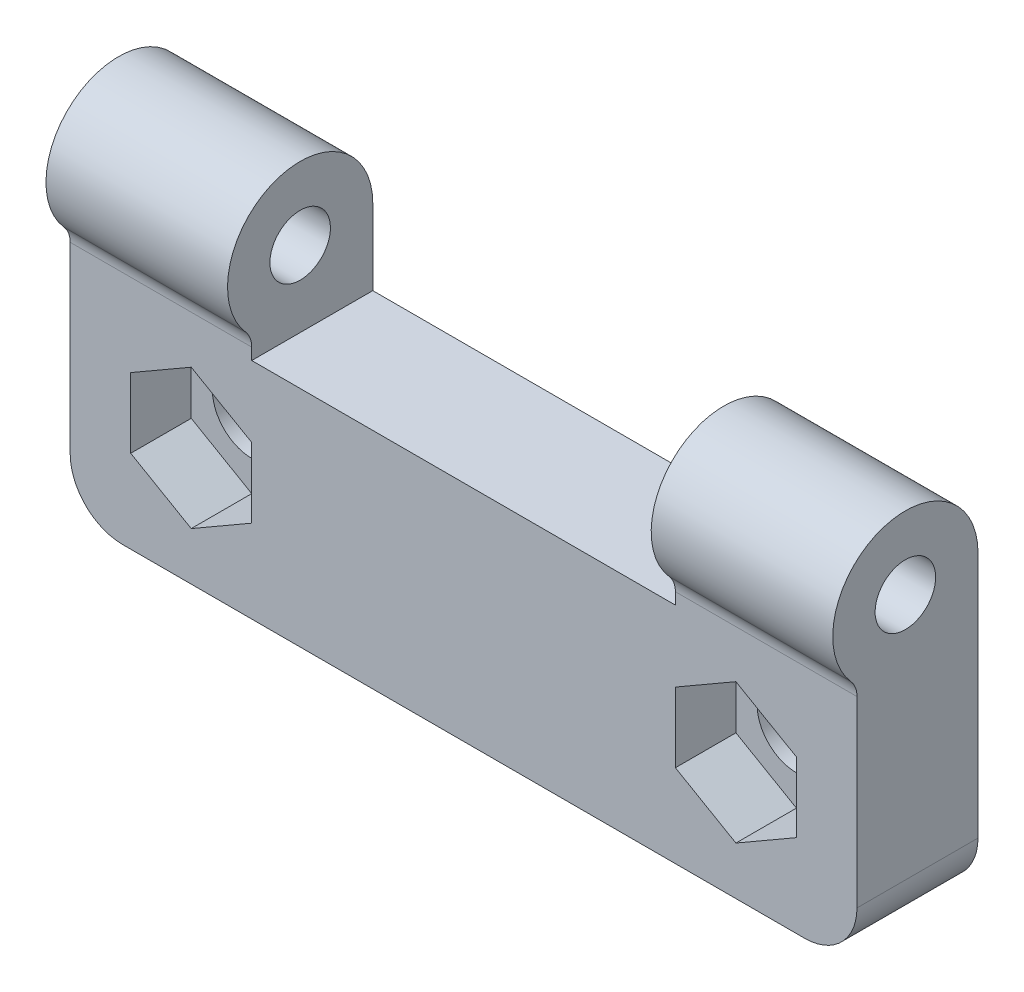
ISO-10303-21;
HEADER;
FILE_DESCRIPTION(('STEP AP214'),'2;1');
FILE_NAME('part.step','',(''),(''),'','','');
FILE_SCHEMA(('AUTOMOTIVE_DESIGN { 1 0 10303 214 1 1 1 1 }'));
ENDSEC;
DATA;
#1=APPLICATION_CONTEXT('core data for automotive mechanical design processes');
#2=APPLICATION_PROTOCOL_DEFINITION('international standard','automotive_design',2000,#1);
#3=PRODUCT_CONTEXT('',#1,'mechanical');
#4=PRODUCT('Part','Part','',(#3));
#5=PRODUCT_RELATED_PRODUCT_CATEGORY('part','',(#4));
#6=PRODUCT_DEFINITION_FORMATION('','',#4);
#7=PRODUCT_DEFINITION_CONTEXT('part definition',#1,'design');
#8=PRODUCT_DEFINITION('design','',#6,#7);
#9=PRODUCT_DEFINITION_SHAPE('','',#8);
#10=(LENGTH_UNIT() NAMED_UNIT(*) SI_UNIT(.MILLI.,.METRE.));
#11=(NAMED_UNIT(*) PLANE_ANGLE_UNIT() SI_UNIT($,.RADIAN.));
#12=(NAMED_UNIT(*) SI_UNIT($,.STERADIAN.) SOLID_ANGLE_UNIT());
#13=UNCERTAINTY_MEASURE_WITH_UNIT(LENGTH_MEASURE(1.E-05),#10,'distance_accuracy_value','');
#14=(GEOMETRIC_REPRESENTATION_CONTEXT(3) GLOBAL_UNCERTAINTY_ASSIGNED_CONTEXT((#13)) GLOBAL_UNIT_ASSIGNED_CONTEXT((#10,
#11,#12)) REPRESENTATION_CONTEXT('',''));
#15=CARTESIAN_POINT('',(0.,0.,0.));
#16=DIRECTION('',(0.,0.,1.));
#17=DIRECTION('',(1.,0.,0.));
#18=AXIS2_PLACEMENT_3D('',#15,#16,#17);
#19=CARTESIAN_POINT('',(0.,0.,5.));
#20=DIRECTION('',(0.,0.,1.));
#21=DIRECTION('',(-1.,0.,0.));
#22=AXIS2_PLACEMENT_3D('',#19,#20,#21);
#23=CYLINDRICAL_SURFACE('',#22,3.25);
#24=CARTESIAN_POINT('',(0.,0.,0.));
#25=DIRECTION('',(0.,0.,1.));
#26=DIRECTION('',(-1.,0.,0.));
#27=AXIS2_PLACEMENT_3D('',#24,#25,#26);
#28=CIRCLE('',#27,3.25);
#29=CARTESIAN_POINT('',(-3.25,0.,0.));
#30=VERTEX_POINT('',#29);
#31=EDGE_CURVE('E375',#30,#30,#28,.F.);
#32=ORIENTED_EDGE('',*,*,#31,.T.);
#33=EDGE_LOOP('',(#32));
#34=FACE_BOUND('',#33,.T.);
#35=CARTESIAN_POINT('',(0.,0.,5.));
#36=DIRECTION('',(0.,0.,1.));
#37=DIRECTION('',(-1.,0.,0.));
#38=AXIS2_PLACEMENT_3D('',#35,#36,#37);
#39=CIRCLE('',#38,3.25);
#40=CARTESIAN_POINT('',(-3.25,0.,5.));
#41=VERTEX_POINT('',#40);
#42=EDGE_CURVE('E18',#41,#41,#39,.F.);
#43=ORIENTED_EDGE('',*,*,#42,.F.);
#44=EDGE_LOOP('',(#43));
#45=FACE_BOUND('',#44,.T.);
#46=ADVANCED_FACE('F14',(#34,#45),#23,.F.);
#47=CARTESIAN_POINT('',(45.,0.,5.));
#48=DIRECTION('',(0.,0.,1.));
#49=DIRECTION('',(-1.,0.,0.));
#50=AXIS2_PLACEMENT_3D('',#47,#48,#49);
#51=CYLINDRICAL_SURFACE('',#50,3.25);
#52=CARTESIAN_POINT('',(45.,0.,0.));
#53=DIRECTION('',(0.,0.,1.));
#54=DIRECTION('',(-1.,0.,0.));
#55=AXIS2_PLACEMENT_3D('',#52,#53,#54);
#56=CIRCLE('',#55,3.25);
#57=CARTESIAN_POINT('',(41.75,0.,0.));
#58=VERTEX_POINT('',#57);
#59=EDGE_CURVE('E306',#58,#58,#56,.F.);
#60=ORIENTED_EDGE('',*,*,#59,.T.);
#61=EDGE_LOOP('',(#60));
#62=FACE_BOUND('',#61,.T.);
#63=CARTESIAN_POINT('',(45.,0.,5.));
#64=DIRECTION('',(0.,0.,1.));
#65=DIRECTION('',(-1.,0.,0.));
#66=AXIS2_PLACEMENT_3D('',#63,#64,#65);
#67=CIRCLE('',#66,3.25);
#68=CARTESIAN_POINT('',(41.75,0.,5.));
#69=VERTEX_POINT('',#68);
#70=EDGE_CURVE('E269',#69,#69,#67,.F.);
#71=ORIENTED_EDGE('',*,*,#70,.F.);
#72=EDGE_LOOP('',(#71));
#73=FACE_BOUND('',#72,.T.);
#74=ADVANCED_FACE('F405',(#62,#73),#51,.F.);
#75=CARTESIAN_POINT('',(-10.,9.70849737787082,12.));
#76=DIRECTION('',(-1.,0.,0.));
#77=DIRECTION('',(0.,-1.,0.));
#78=AXIS2_PLACEMENT_3D('',#75,#76,#77);
#79=CYLINDRICAL_SURFACE('',#78,2.);
#80=DIRECTION('',(-1.,0.,0.));
#81=VECTOR('',#80,1.);
#82=CARTESIAN_POINT('',(-10.,11.0313730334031,10.5));
#83=LINE('',#82,#81);
#84=CARTESIAN_POINT('',(-10.,11.0313730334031,10.5));
#85=VERTEX_POINT('',#84);
#86=CARTESIAN_POINT('',(5.,11.0313730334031,10.5));
#87=VERTEX_POINT('',#86);
#88=EDGE_CURVE('E359',#85,#87,#83,.F.);
#89=ORIENTED_EDGE('',*,*,#88,.F.);
#90=CARTESIAN_POINT('',(-10.,9.70849737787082,12.));
#91=DIRECTION('',(-1.,0.,0.));
#92=DIRECTION('',(0.,-1.,0.));
#93=AXIS2_PLACEMENT_3D('',#90,#91,#92);
#94=CIRCLE('',#93,2.);
#95=CARTESIAN_POINT('',(-10.,9.70849737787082,10.));
#96=VERTEX_POINT('',#95);
#97=EDGE_CURVE('E398',#96,#85,#94,.F.);
#98=ORIENTED_EDGE('',*,*,#97,.F.);
#99=DIRECTION('',(-1.,0.,0.));
#100=VECTOR('',#99,1.);
#101=CARTESIAN_POINT('',(22.5,9.70849737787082,10.));
#102=LINE('',#101,#100);
#103=CARTESIAN_POINT('',(5.,9.70849737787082,10.));
#104=VERTEX_POINT('',#103);
#105=EDGE_CURVE('E357',#104,#96,#102,.T.);
#106=ORIENTED_EDGE('',*,*,#105,.F.);
#107=CARTESIAN_POINT('',(5.,9.70849737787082,12.));
#108=DIRECTION('',(-1.,0.,0.));
#109=DIRECTION('',(0.,-1.,0.));
#110=AXIS2_PLACEMENT_3D('',#107,#108,#109);
#111=CIRCLE('',#110,2.);
#112=EDGE_CURVE('E396',#87,#104,#111,.T.);
#113=ORIENTED_EDGE('',*,*,#112,.F.);
#114=EDGE_LOOP('',(#89,#98,#106,#113));
#115=FACE_BOUND('',#114,.T.);
#116=ADVANCED_FACE('F16',(#115),#79,.F.);
#117=CARTESIAN_POINT('',(-10.,9.70849737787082,12.));
#118=DIRECTION('',(-1.,0.,0.));
#119=DIRECTION('',(0.,-1.,0.));
#120=AXIS2_PLACEMENT_3D('',#117,#118,#119);
#121=CYLINDRICAL_SURFACE('',#120,2.);
#122=DIRECTION('',(-1.,0.,0.));
#123=VECTOR('',#122,1.);
#124=CARTESIAN_POINT('',(22.5,9.70849737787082,10.));
#125=LINE('',#124,#123);
#126=CARTESIAN_POINT('',(55.,9.70849737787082,10.));
#127=VERTEX_POINT('',#126);
#128=CARTESIAN_POINT('',(40.,9.70849737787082,10.));
#129=VERTEX_POINT('',#128);
#130=EDGE_CURVE('E354',#127,#129,#125,.T.);
#131=ORIENTED_EDGE('',*,*,#130,.F.);
#132=CARTESIAN_POINT('',(55.,9.70849737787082,12.));
#133=DIRECTION('',(-1.,0.,0.));
#134=DIRECTION('',(0.,-1.,0.));
#135=AXIS2_PLACEMENT_3D('',#132,#133,#134);
#136=CIRCLE('',#135,2.);
#137=CARTESIAN_POINT('',(55.,11.0313730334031,10.5));
#138=VERTEX_POINT('',#137);
#139=EDGE_CURVE('E394',#138,#127,#136,.T.);
#140=ORIENTED_EDGE('',*,*,#139,.F.);
#141=DIRECTION('',(-1.,0.,0.));
#142=VECTOR('',#141,1.);
#143=CARTESIAN_POINT('',(-10.,11.0313730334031,10.5));
#144=LINE('',#143,#142);
#145=CARTESIAN_POINT('',(40.,11.0313730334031,10.5));
#146=VERTEX_POINT('',#145);
#147=EDGE_CURVE('E349',#146,#138,#144,.F.);
#148=ORIENTED_EDGE('',*,*,#147,.F.);
#149=CARTESIAN_POINT('',(40.,9.70849737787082,12.));
#150=DIRECTION('',(-1.,0.,0.));
#151=DIRECTION('',(0.,-1.,0.));
#152=AXIS2_PLACEMENT_3D('',#149,#150,#151);
#153=CIRCLE('',#152,2.);
#154=EDGE_CURVE('E363',#129,#146,#153,.F.);
#155=ORIENTED_EDGE('',*,*,#154,.F.);
#156=EDGE_LOOP('',(#131,#140,#148,#155));
#157=FACE_BOUND('',#156,.T.);
#158=ADVANCED_FACE('F416',(#157),#121,.F.);
#159=CARTESIAN_POINT('',(-10.,15.,6.));
#160=DIRECTION('',(-1.,0.,0.));
#161=DIRECTION('',(0.,-1.,0.));
#162=AXIS2_PLACEMENT_3D('',#159,#160,#161);
#163=CYLINDRICAL_SURFACE('',#162,2.5);
#164=CARTESIAN_POINT('',(5.,15.,6.));
#165=DIRECTION('',(-1.,0.,0.));
#166=DIRECTION('',(0.,-1.,0.));
#167=AXIS2_PLACEMENT_3D('',#164,#165,#166);
#168=CIRCLE('',#167,2.5);
#169=CARTESIAN_POINT('',(5.,12.5,6.));
#170=VERTEX_POINT('',#169);
#171=EDGE_CURVE('E344',#170,#170,#168,.F.);
#172=ORIENTED_EDGE('',*,*,#171,.T.);
#173=EDGE_LOOP('',(#172));
#174=FACE_BOUND('',#173,.T.);
#175=CARTESIAN_POINT('',(-10.,15.,6.));
#176=DIRECTION('',(-1.,0.,0.));
#177=DIRECTION('',(0.,-1.,0.));
#178=AXIS2_PLACEMENT_3D('',#175,#176,#177);
#179=CIRCLE('',#178,2.5);
#180=CARTESIAN_POINT('',(-10.,12.5,6.));
#181=VERTEX_POINT('',#180);
#182=EDGE_CURVE('E328',#181,#181,#179,.F.);
#183=ORIENTED_EDGE('',*,*,#182,.F.);
#184=EDGE_LOOP('',(#183));
#185=FACE_BOUND('',#184,.T.);
#186=ADVANCED_FACE('F517',(#174,#185),#163,.F.);
#187=CARTESIAN_POINT('',(22.5,15.,10.));
#188=DIRECTION('',(0.,0.,1.));
#189=DIRECTION('',(-1.,0.,0.));
#190=AXIS2_PLACEMENT_3D('',#187,#188,#189);
#191=PLANE('',#190);
#192=DIRECTION('',(0.866025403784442,-0.5,0.));
#193=VECTOR('',#192,1.);
#194=CARTESIAN_POINT('',(-5.,-2.8867513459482,10.));
#195=LINE('',#194,#193);
#196=CARTESIAN_POINT('',(-5.,-2.8867513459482,10.));
#197=VERTEX_POINT('',#196);
#198=CARTESIAN_POINT('',(0.,-5.77350269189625,10.));
#199=VERTEX_POINT('',#198);
#200=EDGE_CURVE('E31',#197,#199,#195,.T.);
#201=ORIENTED_EDGE('',*,*,#200,.F.);
#202=DIRECTION('',(0.,-1.,0.));
#203=VECTOR('',#202,1.);
#204=CARTESIAN_POINT('',(-5.,2.88675134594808,10.));
#205=LINE('',#204,#203);
#206=CARTESIAN_POINT('',(-5.,2.88675134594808,10.));
#207=VERTEX_POINT('',#206);
#208=EDGE_CURVE('E199',#207,#197,#205,.T.);
#209=ORIENTED_EDGE('',*,*,#208,.F.);
#210=DIRECTION('',(-0.866025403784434,-0.500000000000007,0.));
#211=VECTOR('',#210,1.);
#212=CARTESIAN_POINT('',(0.,5.77350269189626,10.));
#213=LINE('',#212,#211);
#214=CARTESIAN_POINT('',(0.,5.77350269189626,10.));
#215=VERTEX_POINT('',#214);
#216=EDGE_CURVE('E202',#215,#207,#213,.T.);
#217=ORIENTED_EDGE('',*,*,#216,.F.);
#218=DIRECTION('',(-0.866025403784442,0.5,0.));
#219=VECTOR('',#218,1.);
#220=CARTESIAN_POINT('',(5.,2.88675134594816,10.));
#221=LINE('',#220,#219);
#222=CARTESIAN_POINT('',(5.,2.88675134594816,10.));
#223=VERTEX_POINT('',#222);
#224=EDGE_CURVE('E218',#223,#215,#221,.T.);
#225=ORIENTED_EDGE('',*,*,#224,.F.);
#226=DIRECTION('',(0.,1.,0.));
#227=VECTOR('',#226,1.);
#228=CARTESIAN_POINT('',(5.,-2.8867513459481,10.));
#229=LINE('',#228,#227);
#230=CARTESIAN_POINT('',(5.,-2.8867513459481,10.));
#231=VERTEX_POINT('',#230);
#232=EDGE_CURVE('E215',#231,#223,#229,.T.);
#233=ORIENTED_EDGE('',*,*,#232,.F.);
#234=DIRECTION('',(0.866025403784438,0.5,0.));
#235=VECTOR('',#234,1.);
#236=CARTESIAN_POINT('',(0.,-5.77350269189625,10.));
#237=LINE('',#236,#235);
#238=EDGE_CURVE('E213',#199,#231,#237,.T.);
#239=ORIENTED_EDGE('',*,*,#238,.F.);
#240=EDGE_LOOP('',(#201,#209,#217,#225,#233,#239));
#241=FACE_BOUND('',#240,.T.);
#242=DIRECTION('',(0.866025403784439,-0.5,0.));
#243=VECTOR('',#242,1.);
#244=CARTESIAN_POINT('',(40.,-2.88675134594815,10.));
#245=LINE('',#244,#243);
#246=CARTESIAN_POINT('',(40.,-2.88675134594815,10.));
#247=VERTEX_POINT('',#246);
#248=CARTESIAN_POINT('',(45.,-5.77350269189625,10.));
#249=VERTEX_POINT('',#248);
#250=EDGE_CURVE('E39',#247,#249,#245,.T.);
#251=ORIENTED_EDGE('',*,*,#250,.F.);
#252=DIRECTION('',(0.,-1.,0.));
#253=VECTOR('',#252,1.);
#254=CARTESIAN_POINT('',(40.,2.88675134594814,10.));
#255=LINE('',#254,#253);
#256=CARTESIAN_POINT('',(40.,2.88675134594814,10.));
#257=VERTEX_POINT('',#256);
#258=EDGE_CURVE('E236',#257,#247,#255,.T.);
#259=ORIENTED_EDGE('',*,*,#258,.F.);
#260=DIRECTION('',(-0.866025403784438,-0.5,0.));
#261=VECTOR('',#260,1.);
#262=CARTESIAN_POINT('',(45.,5.77350269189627,10.));
#263=LINE('',#262,#261);
#264=CARTESIAN_POINT('',(45.,5.77350269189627,10.));
#265=VERTEX_POINT('',#264);
#266=EDGE_CURVE('E262',#265,#257,#263,.T.);
#267=ORIENTED_EDGE('',*,*,#266,.F.);
#268=DIRECTION('',(-0.866025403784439,0.5,0.));
#269=VECTOR('',#268,1.);
#270=CARTESIAN_POINT('',(50.,2.88675134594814,10.));
#271=LINE('',#270,#269);
#272=CARTESIAN_POINT('',(50.,2.88675134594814,10.));
#273=VERTEX_POINT('',#272);
#274=EDGE_CURVE('E259',#273,#265,#271,.T.);
#275=ORIENTED_EDGE('',*,*,#274,.F.);
#276=DIRECTION('',(0.,1.,0.));
#277=VECTOR('',#276,1.);
#278=CARTESIAN_POINT('',(50.,-2.88675134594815,10.));
#279=LINE('',#278,#277);
#280=CARTESIAN_POINT('',(50.,-2.88675134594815,10.));
#281=VERTEX_POINT('',#280);
#282=EDGE_CURVE('E256',#281,#273,#279,.T.);
#283=ORIENTED_EDGE('',*,*,#282,.F.);
#284=DIRECTION('',(0.866025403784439,0.5,0.));
#285=VECTOR('',#284,1.);
#286=CARTESIAN_POINT('',(45.,-5.77350269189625,10.));
#287=LINE('',#286,#285);
#288=EDGE_CURVE('E253',#249,#281,#287,.T.);
#289=ORIENTED_EDGE('',*,*,#288,.F.);
#290=EDGE_LOOP('',(#251,#259,#267,#275,#283,#289));
#291=FACE_BOUND('',#290,.T.);
#292=DIRECTION('',(0.,1.,0.));
#293=VECTOR('',#292,1.);
#294=CARTESIAN_POINT('',(55.,6.58333333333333,10.));
#295=LINE('',#294,#293);
#296=CARTESIAN_POINT('',(55.,-5.4166666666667,10.));
#297=VERTEX_POINT('',#296);
#298=EDGE_CURVE('E309',#127,#297,#295,.F.);
#299=ORIENTED_EDGE('',*,*,#298,.F.);
#300=ORIENTED_EDGE('',*,*,#130,.T.);
#301=DIRECTION('',(0.,-1.,0.));
#302=VECTOR('',#301,1.);
#303=CARTESIAN_POINT('',(40.,15.,10.));
#304=LINE('',#303,#302);
#305=CARTESIAN_POINT('',(40.,8.75,10.));
#306=VERTEX_POINT('',#305);
#307=EDGE_CURVE('E362',#129,#306,#304,.T.);
#308=ORIENTED_EDGE('',*,*,#307,.T.);
#309=DIRECTION('',(1.,0.,0.));
#310=VECTOR('',#309,1.);
#311=CARTESIAN_POINT('',(40.,8.75,10.));
#312=LINE('',#311,#310);
#313=CARTESIAN_POINT('',(5.,8.75,10.));
#314=VERTEX_POINT('',#313);
#315=EDGE_CURVE('E347',#306,#314,#312,.F.);
#316=ORIENTED_EDGE('',*,*,#315,.T.);
#317=DIRECTION('',(0.,-1.,0.));
#318=VECTOR('',#317,1.);
#319=CARTESIAN_POINT('',(5.,8.75,10.));
#320=LINE('',#319,#318);
#321=EDGE_CURVE('E335',#314,#104,#320,.F.);
#322=ORIENTED_EDGE('',*,*,#321,.T.);
#323=ORIENTED_EDGE('',*,*,#105,.T.);
#324=DIRECTION('',(0.,-1.,0.));
#325=VECTOR('',#324,1.);
#326=CARTESIAN_POINT('',(-10.,-5.4166666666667,10.));
#327=LINE('',#326,#325);
#328=CARTESIAN_POINT('',(-10.,-5.4166666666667,10.));
#329=VERTEX_POINT('',#328);
#330=EDGE_CURVE('E324',#329,#96,#327,.F.);
#331=ORIENTED_EDGE('',*,*,#330,.F.);
#332=CARTESIAN_POINT('',(-5.6666666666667,-5.4166666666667,10.));
#333=DIRECTION('',(0.,0.,-1.));
#334=DIRECTION('',(1.,0.,0.));
#335=AXIS2_PLACEMENT_3D('',#332,#333,#334);
#336=CIRCLE('',#335,4.33333333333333);
#337=CARTESIAN_POINT('',(-5.6666666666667,-9.75,10.));
#338=VERTEX_POINT('',#337);
#339=EDGE_CURVE('E323',#338,#329,#336,.T.);
#340=ORIENTED_EDGE('',*,*,#339,.F.);
#341=DIRECTION('',(1.,0.,0.));
#342=VECTOR('',#341,1.);
#343=CARTESIAN_POINT('',(50.6666666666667,-9.75,10.));
#344=LINE('',#343,#342);
#345=CARTESIAN_POINT('',(50.6666666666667,-9.75,10.));
#346=VERTEX_POINT('',#345);
#347=EDGE_CURVE('E320',#346,#338,#344,.F.);
#348=ORIENTED_EDGE('',*,*,#347,.F.);
#349=CARTESIAN_POINT('',(50.6666666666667,-5.4166666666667,10.));
#350=DIRECTION('',(0.,0.,-1.));
#351=DIRECTION('',(1.,0.,0.));
#352=AXIS2_PLACEMENT_3D('',#349,#350,#351);
#353=CIRCLE('',#352,4.33333333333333);
#354=EDGE_CURVE('E317',#297,#346,#353,.T.);
#355=ORIENTED_EDGE('',*,*,#354,.F.);
#356=EDGE_LOOP('',(#299,#300,#308,#316,#322,#323,#331,#340,#348,#355));
#357=FACE_BOUND('',#356,.T.);
#358=ADVANCED_FACE('F479',(#241,#291,#357),#191,.T.);
#359=CARTESIAN_POINT('',(-10.,15.,6.));
#360=DIRECTION('',(-1.,0.,0.));
#361=DIRECTION('',(0.,-1.,0.));
#362=AXIS2_PLACEMENT_3D('',#359,#360,#361);
#363=CYLINDRICAL_SURFACE('',#362,2.5);
#364=CARTESIAN_POINT('',(55.,15.,6.));
#365=DIRECTION('',(-1.,0.,0.));
#366=DIRECTION('',(0.,-1.,0.));
#367=AXIS2_PLACEMENT_3D('',#364,#365,#366);
#368=CIRCLE('',#367,2.5);
#369=CARTESIAN_POINT('',(55.,12.5,6.));
#370=VERTEX_POINT('',#369);
#371=EDGE_CURVE('E312',#370,#370,#368,.T.);
#372=ORIENTED_EDGE('',*,*,#371,.F.);
#373=EDGE_LOOP('',(#372));
#374=FACE_BOUND('',#373,.T.);
#375=CARTESIAN_POINT('',(40.,15.,6.));
#376=DIRECTION('',(-1.,0.,0.));
#377=DIRECTION('',(0.,-1.,0.));
#378=AXIS2_PLACEMENT_3D('',#375,#376,#377);
#379=CIRCLE('',#378,2.5);
#380=CARTESIAN_POINT('',(40.,12.5,6.));
#381=VERTEX_POINT('',#380);
#382=EDGE_CURVE('E299',#381,#381,#379,.T.);
#383=ORIENTED_EDGE('',*,*,#382,.T.);
#384=EDGE_LOOP('',(#383));
#385=FACE_BOUND('',#384,.T.);
#386=ADVANCED_FACE('F473',(#374,#385),#363,.F.);
#387=CARTESIAN_POINT('',(40.,8.75,0.));
#388=DIRECTION('',(0.,-1.,0.));
#389=DIRECTION('',(1.,0.,0.));
#390=AXIS2_PLACEMENT_3D('',#387,#388,#389);
#391=PLANE('',#390);
#392=DIRECTION('',(0.,0.,1.));
#393=VECTOR('',#392,1.);
#394=CARTESIAN_POINT('',(40.,8.75,0.));
#395=LINE('',#394,#393);
#396=CARTESIAN_POINT('',(40.,8.75,0.));
#397=VERTEX_POINT('',#396);
#398=EDGE_CURVE('E295',#306,#397,#395,.F.);
#399=ORIENTED_EDGE('',*,*,#398,.T.);
#400=DIRECTION('',(-1.,0.,0.));
#401=VECTOR('',#400,1.);
#402=CARTESIAN_POINT('',(22.5,8.75,0.));
#403=LINE('',#402,#401);
#404=CARTESIAN_POINT('',(5.,8.75,0.));
#405=VERTEX_POINT('',#404);
#406=EDGE_CURVE('E302',#397,#405,#403,.T.);
#407=ORIENTED_EDGE('',*,*,#406,.T.);
#408=DIRECTION('',(0.,0.,1.));
#409=VECTOR('',#408,1.);
#410=CARTESIAN_POINT('',(5.,8.75,0.));
#411=LINE('',#410,#409);
#412=EDGE_CURVE('E339',#405,#314,#411,.T.);
#413=ORIENTED_EDGE('',*,*,#412,.T.);
#414=ORIENTED_EDGE('',*,*,#315,.F.);
#415=EDGE_LOOP('',(#399,#407,#413,#414));
#416=FACE_BOUND('',#415,.T.);
#417=ADVANCED_FACE('F470',(#416),#391,.F.);
#418=CARTESIAN_POINT('',(5.,8.75,0.));
#419=DIRECTION('',(-1.,0.,0.));
#420=DIRECTION('',(0.,-1.,0.));
#421=AXIS2_PLACEMENT_3D('',#418,#419,#420);
#422=PLANE('',#421);
#423=ORIENTED_EDGE('',*,*,#112,.T.);
#424=ORIENTED_EDGE('',*,*,#321,.F.);
#425=ORIENTED_EDGE('',*,*,#412,.F.);
#426=DIRECTION('',(0.,-1.,0.));
#427=VECTOR('',#426,1.);
#428=CARTESIAN_POINT('',(5.,15.,0.));
#429=LINE('',#428,#427);
#430=CARTESIAN_POINT('',(5.,15.,0.));
#431=VERTEX_POINT('',#430);
#432=EDGE_CURVE('E305',#405,#431,#429,.F.);
#433=ORIENTED_EDGE('',*,*,#432,.T.);
#434=CARTESIAN_POINT('',(5.,15.,6.));
#435=DIRECTION('',(-1.,0.,0.));
#436=DIRECTION('',(0.,-1.,0.));
#437=AXIS2_PLACEMENT_3D('',#434,#435,#436);
#438=CIRCLE('',#437,6.);
#439=EDGE_CURVE('E338',#87,#431,#438,.T.);
#440=ORIENTED_EDGE('',*,*,#439,.F.);
#441=EDGE_LOOP('',(#423,#424,#425,#433,#440));
#442=FACE_BOUND('',#441,.T.);
#443=ORIENTED_EDGE('',*,*,#171,.F.);
#444=EDGE_LOOP('',(#443));
#445=FACE_BOUND('',#444,.T.);
#446=ADVANCED_FACE('F467',(#442,#445),#422,.F.);
#447=CARTESIAN_POINT('',(-10.,15.,6.));
#448=DIRECTION('',(-1.,0.,0.));
#449=DIRECTION('',(0.,-1.,0.));
#450=AXIS2_PLACEMENT_3D('',#447,#448,#449);
#451=CYLINDRICAL_SURFACE('',#450,6.);
#452=DIRECTION('',(-1.,0.,0.));
#453=VECTOR('',#452,1.);
#454=CARTESIAN_POINT('',(22.5,15.,0.));
#455=LINE('',#454,#453);
#456=CARTESIAN_POINT('',(-10.,15.,0.));
#457=VERTEX_POINT('',#456);
#458=EDGE_CURVE('E290',#431,#457,#455,.T.);
#459=ORIENTED_EDGE('',*,*,#458,.T.);
#460=CARTESIAN_POINT('',(-10.,15.,6.));
#461=DIRECTION('',(-1.,0.,0.));
#462=DIRECTION('',(0.,-1.,0.));
#463=AXIS2_PLACEMENT_3D('',#460,#461,#462);
#464=CIRCLE('',#463,6.);
#465=EDGE_CURVE('E327',#85,#457,#464,.T.);
#466=ORIENTED_EDGE('',*,*,#465,.F.);
#467=ORIENTED_EDGE('',*,*,#88,.T.);
#468=ORIENTED_EDGE('',*,*,#439,.T.);
#469=EDGE_LOOP('',(#459,#466,#467,#468));
#470=FACE_BOUND('',#469,.T.);
#471=ADVANCED_FACE('F463',(#470),#451,.T.);
#472=CARTESIAN_POINT('',(-10.,-5.4166666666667,0.));
#473=DIRECTION('',(-1.,0.,0.));
#474=DIRECTION('',(0.,-1.,0.));
#475=AXIS2_PLACEMENT_3D('',#472,#473,#474);
#476=PLANE('',#475);
#477=ORIENTED_EDGE('',*,*,#97,.T.);
#478=ORIENTED_EDGE('',*,*,#465,.T.);
#479=DIRECTION('',(0.,-1.,0.));
#480=VECTOR('',#479,1.);
#481=CARTESIAN_POINT('',(-10.,15.,0.));
#482=LINE('',#481,#480);
#483=CARTESIAN_POINT('',(-10.,-5.4166666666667,0.));
#484=VERTEX_POINT('',#483);
#485=EDGE_CURVE('E287',#457,#484,#482,.T.);
#486=ORIENTED_EDGE('',*,*,#485,.T.);
#487=DIRECTION('',(0.,0.,-1.));
#488=VECTOR('',#487,1.);
#489=CARTESIAN_POINT('',(-10.,-5.4166666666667,0.));
#490=LINE('',#489,#488);
#491=EDGE_CURVE('E321',#329,#484,#490,.T.);
#492=ORIENTED_EDGE('',*,*,#491,.F.);
#493=ORIENTED_EDGE('',*,*,#330,.T.);
#494=EDGE_LOOP('',(#477,#478,#486,#492,#493));
#495=FACE_BOUND('',#494,.T.);
#496=ORIENTED_EDGE('',*,*,#182,.T.);
#497=EDGE_LOOP('',(#496));
#498=FACE_BOUND('',#497,.T.);
#499=ADVANCED_FACE('F459',(#495,#498),#476,.T.);
#500=CARTESIAN_POINT('',(-5.6666666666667,-5.4166666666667,0.));
#501=DIRECTION('',(0.,0.,-1.));
#502=DIRECTION('',(1.,0.,0.));
#503=AXIS2_PLACEMENT_3D('',#500,#501,#502);
#504=CYLINDRICAL_SURFACE('',#503,4.33333333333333);
#505=CARTESIAN_POINT('',(-5.6666666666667,-5.4166666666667,0.));
#506=DIRECTION('',(0.,0.,-1.));
#507=DIRECTION('',(1.,0.,0.));
#508=AXIS2_PLACEMENT_3D('',#505,#506,#507);
#509=CIRCLE('',#508,4.33333333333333);
#510=CARTESIAN_POINT('',(-5.6666666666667,-9.75,0.));
#511=VERTEX_POINT('',#510);
#512=EDGE_CURVE('E286',#484,#511,#509,.F.);
#513=ORIENTED_EDGE('',*,*,#512,.T.);
#514=DIRECTION('',(0.,0.,1.));
#515=VECTOR('',#514,1.);
#516=CARTESIAN_POINT('',(-5.6666666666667,-9.75,0.));
#517=LINE('',#516,#515);
#518=EDGE_CURVE('E318',#338,#511,#517,.F.);
#519=ORIENTED_EDGE('',*,*,#518,.F.);
#520=ORIENTED_EDGE('',*,*,#339,.T.);
#521=ORIENTED_EDGE('',*,*,#491,.T.);
#522=EDGE_LOOP('',(#513,#519,#520,#521));
#523=FACE_BOUND('',#522,.T.);
#524=ADVANCED_FACE('F455',(#523),#504,.T.);
#525=CARTESIAN_POINT('',(50.6666666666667,-9.75,0.));
#526=DIRECTION('',(0.,-1.,0.));
#527=DIRECTION('',(1.,0.,0.));
#528=AXIS2_PLACEMENT_3D('',#525,#526,#527);
#529=PLANE('',#528);
#530=DIRECTION('',(-1.,0.,0.));
#531=VECTOR('',#530,1.);
#532=CARTESIAN_POINT('',(22.5,-9.75,0.));
#533=LINE('',#532,#531);
#534=CARTESIAN_POINT('',(50.6666666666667,-9.75,0.));
#535=VERTEX_POINT('',#534);
#536=EDGE_CURVE('E283',#511,#535,#533,.F.);
#537=ORIENTED_EDGE('',*,*,#536,.T.);
#538=DIRECTION('',(0.,0.,-1.));
#539=VECTOR('',#538,1.);
#540=CARTESIAN_POINT('',(50.6666666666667,-9.75,0.));
#541=LINE('',#540,#539);
#542=EDGE_CURVE('E315',#346,#535,#541,.T.);
#543=ORIENTED_EDGE('',*,*,#542,.F.);
#544=ORIENTED_EDGE('',*,*,#347,.T.);
#545=ORIENTED_EDGE('',*,*,#518,.T.);
#546=EDGE_LOOP('',(#537,#543,#544,#545));
#547=FACE_BOUND('',#546,.T.);
#548=ADVANCED_FACE('F451',(#547),#529,.T.);
#549=CARTESIAN_POINT('',(50.6666666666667,-5.4166666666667,0.));
#550=DIRECTION('',(0.,0.,-1.));
#551=DIRECTION('',(1.,0.,0.));
#552=AXIS2_PLACEMENT_3D('',#549,#550,#551);
#553=CYLINDRICAL_SURFACE('',#552,4.33333333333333);
#554=CARTESIAN_POINT('',(50.6666666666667,-5.4166666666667,0.));
#555=DIRECTION('',(0.,0.,-1.));
#556=DIRECTION('',(1.,0.,0.));
#557=AXIS2_PLACEMENT_3D('',#554,#555,#556);
#558=CIRCLE('',#557,4.33333333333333);
#559=CARTESIAN_POINT('',(55.,-5.4166666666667,0.));
#560=VERTEX_POINT('',#559);
#561=EDGE_CURVE('E282',#535,#560,#558,.F.);
#562=ORIENTED_EDGE('',*,*,#561,.T.);
#563=DIRECTION('',(0.,0.,1.));
#564=VECTOR('',#563,1.);
#565=CARTESIAN_POINT('',(55.,-5.4166666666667,0.));
#566=LINE('',#565,#564);
#567=EDGE_CURVE('E311',#297,#560,#566,.F.);
#568=ORIENTED_EDGE('',*,*,#567,.F.);
#569=ORIENTED_EDGE('',*,*,#354,.T.);
#570=ORIENTED_EDGE('',*,*,#542,.T.);
#571=EDGE_LOOP('',(#562,#568,#569,#570));
#572=FACE_BOUND('',#571,.T.);
#573=ADVANCED_FACE('F447',(#572),#553,.T.);
#574=CARTESIAN_POINT('',(55.,6.58333333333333,0.));
#575=DIRECTION('',(1.,0.,0.));
#576=DIRECTION('',(0.,1.,0.));
#577=AXIS2_PLACEMENT_3D('',#574,#575,#576);
#578=PLANE('',#577);
#579=CARTESIAN_POINT('',(55.,15.,6.));
#580=DIRECTION('',(-1.,0.,0.));
#581=DIRECTION('',(0.,-1.,0.));
#582=AXIS2_PLACEMENT_3D('',#579,#580,#581);
#583=CIRCLE('',#582,6.);
#584=CARTESIAN_POINT('',(55.,15.,0.));
#585=VERTEX_POINT('',#584);
#586=EDGE_CURVE('E314',#138,#585,#583,.T.);
#587=ORIENTED_EDGE('',*,*,#586,.F.);
#588=ORIENTED_EDGE('',*,*,#139,.T.);
#589=ORIENTED_EDGE('',*,*,#298,.T.);
#590=ORIENTED_EDGE('',*,*,#567,.T.);
#591=DIRECTION('',(0.,-1.,0.));
#592=VECTOR('',#591,1.);
#593=CARTESIAN_POINT('',(55.,15.,0.));
#594=LINE('',#593,#592);
#595=EDGE_CURVE('E279',#560,#585,#594,.F.);
#596=ORIENTED_EDGE('',*,*,#595,.T.);
#597=EDGE_LOOP('',(#587,#588,#589,#590,#596));
#598=FACE_BOUND('',#597,.T.);
#599=ORIENTED_EDGE('',*,*,#371,.T.);
#600=EDGE_LOOP('',(#599));
#601=FACE_BOUND('',#600,.T.);
#602=ADVANCED_FACE('F443',(#598,#601),#578,.T.);
#603=CARTESIAN_POINT('',(-10.,15.,6.));
#604=DIRECTION('',(-1.,0.,0.));
#605=DIRECTION('',(0.,-1.,0.));
#606=AXIS2_PLACEMENT_3D('',#603,#604,#605);
#607=CYLINDRICAL_SURFACE('',#606,6.);
#608=DIRECTION('',(-1.,0.,0.));
#609=VECTOR('',#608,1.);
#610=CARTESIAN_POINT('',(22.5,15.,0.));
#611=LINE('',#610,#609);
#612=CARTESIAN_POINT('',(40.,15.,0.));
#613=VERTEX_POINT('',#612);
#614=EDGE_CURVE('E23',#585,#613,#611,.T.);
#615=ORIENTED_EDGE('',*,*,#614,.T.);
#616=CARTESIAN_POINT('',(40.,15.,6.));
#617=DIRECTION('',(-1.,0.,0.));
#618=DIRECTION('',(0.,-1.,0.));
#619=AXIS2_PLACEMENT_3D('',#616,#617,#618);
#620=CIRCLE('',#619,6.);
#621=EDGE_CURVE('E298',#613,#146,#620,.F.);
#622=ORIENTED_EDGE('',*,*,#621,.T.);
#623=ORIENTED_EDGE('',*,*,#147,.T.);
#624=ORIENTED_EDGE('',*,*,#586,.T.);
#625=EDGE_LOOP('',(#615,#622,#623,#624));
#626=FACE_BOUND('',#625,.T.);
#627=ADVANCED_FACE('F433',(#626),#607,.T.);
#628=CARTESIAN_POINT('',(40.,28.75,0.));
#629=DIRECTION('',(1.,0.,0.));
#630=DIRECTION('',(0.,1.,0.));
#631=AXIS2_PLACEMENT_3D('',#628,#629,#630);
#632=PLANE('',#631);
#633=DIRECTION('',(0.,-1.,0.));
#634=VECTOR('',#633,1.);
#635=CARTESIAN_POINT('',(40.,15.,0.));
#636=LINE('',#635,#634);
#637=EDGE_CURVE('E9',#613,#397,#636,.T.);
#638=ORIENTED_EDGE('',*,*,#637,.T.);
#639=ORIENTED_EDGE('',*,*,#398,.F.);
#640=ORIENTED_EDGE('',*,*,#307,.F.);
#641=ORIENTED_EDGE('',*,*,#154,.T.);
#642=ORIENTED_EDGE('',*,*,#621,.F.);
#643=EDGE_LOOP('',(#638,#639,#640,#641,#642));
#644=FACE_BOUND('',#643,.T.);
#645=ORIENTED_EDGE('',*,*,#382,.F.);
#646=EDGE_LOOP('',(#645));
#647=FACE_BOUND('',#646,.T.);
#648=ADVANCED_FACE('F422',(#644,#647),#632,.F.);
#649=CARTESIAN_POINT('',(22.5,15.,0.));
#650=DIRECTION('',(0.,0.,1.));
#651=DIRECTION('',(-1.,0.,0.));
#652=AXIS2_PLACEMENT_3D('',#649,#650,#651);
#653=PLANE('',#652);
#654=ORIENTED_EDGE('',*,*,#614,.F.);
#655=ORIENTED_EDGE('',*,*,#595,.F.);
#656=ORIENTED_EDGE('',*,*,#561,.F.);
#657=ORIENTED_EDGE('',*,*,#536,.F.);
#658=ORIENTED_EDGE('',*,*,#512,.F.);
#659=ORIENTED_EDGE('',*,*,#485,.F.);
#660=ORIENTED_EDGE('',*,*,#458,.F.);
#661=ORIENTED_EDGE('',*,*,#432,.F.);
#662=ORIENTED_EDGE('',*,*,#406,.F.);
#663=ORIENTED_EDGE('',*,*,#637,.F.);
#664=EDGE_LOOP('',(#654,#655,#656,#657,#658,#659,#660,#661,#662,#663));
#665=FACE_BOUND('',#664,.T.);
#666=ORIENTED_EDGE('',*,*,#59,.F.);
#667=EDGE_LOOP('',(#666));
#668=FACE_BOUND('',#667,.T.);
#669=ORIENTED_EDGE('',*,*,#31,.F.);
#670=EDGE_LOOP('',(#669));
#671=FACE_BOUND('',#670,.T.);
#672=ADVANCED_FACE('F409',(#665,#668,#671),#653,.F.);
#673=CARTESIAN_POINT('',(45.,-5.77350269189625,5.));
#674=DIRECTION('',(0.,0.,1.));
#675=DIRECTION('',(-1.,0.,0.));
#676=AXIS2_PLACEMENT_3D('',#673,#674,#675);
#677=PLANE('',#676);
#678=DIRECTION('',(0.866025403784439,-0.5,0.));
#679=VECTOR('',#678,1.);
#680=CARTESIAN_POINT('',(40.,-2.88675134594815,5.));
#681=LINE('',#680,#679);
#682=CARTESIAN_POINT('',(40.,-2.88675134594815,5.));
#683=VERTEX_POINT('',#682);
#684=CARTESIAN_POINT('',(45.,-5.77350269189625,5.));
#685=VERTEX_POINT('',#684);
#686=EDGE_CURVE('E232',#683,#685,#681,.T.);
#687=ORIENTED_EDGE('',*,*,#686,.T.);
#688=DIRECTION('',(0.866025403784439,0.5,0.));
#689=VECTOR('',#688,1.);
#690=CARTESIAN_POINT('',(45.,-5.77350269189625,5.));
#691=LINE('',#690,#689);
#692=CARTESIAN_POINT('',(50.,-2.88675134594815,5.));
#693=VERTEX_POINT('',#692);
#694=EDGE_CURVE('E235',#685,#693,#691,.T.);
#695=ORIENTED_EDGE('',*,*,#694,.T.);
#696=DIRECTION('',(0.,1.,0.));
#697=VECTOR('',#696,1.);
#698=CARTESIAN_POINT('',(50.,-2.88675134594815,5.));
#699=LINE('',#698,#697);
#700=CARTESIAN_POINT('',(50.,2.88675134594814,5.));
#701=VERTEX_POINT('',#700);
#702=EDGE_CURVE('E239',#693,#701,#699,.T.);
#703=ORIENTED_EDGE('',*,*,#702,.T.);
#704=DIRECTION('',(-0.866025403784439,0.5,0.));
#705=VECTOR('',#704,1.);
#706=CARTESIAN_POINT('',(50.,2.88675134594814,5.));
#707=LINE('',#706,#705);
#708=CARTESIAN_POINT('',(45.,5.77350269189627,5.));
#709=VERTEX_POINT('',#708);
#710=EDGE_CURVE('E242',#701,#709,#707,.T.);
#711=ORIENTED_EDGE('',*,*,#710,.T.);
#712=DIRECTION('',(-0.866025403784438,-0.5,0.));
#713=VECTOR('',#712,1.);
#714=CARTESIAN_POINT('',(45.,5.77350269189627,5.));
#715=LINE('',#714,#713);
#716=CARTESIAN_POINT('',(40.,2.88675134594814,5.));
#717=VERTEX_POINT('',#716);
#718=EDGE_CURVE('E245',#709,#717,#715,.T.);
#719=ORIENTED_EDGE('',*,*,#718,.T.);
#720=DIRECTION('',(0.,-1.,0.));
#721=VECTOR('',#720,1.);
#722=CARTESIAN_POINT('',(40.,2.88675134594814,5.));
#723=LINE('',#722,#721);
#724=EDGE_CURVE('E248',#717,#683,#723,.T.);
#725=ORIENTED_EDGE('',*,*,#724,.T.);
#726=EDGE_LOOP('',(#687,#695,#703,#711,#719,#725));
#727=FACE_BOUND('',#726,.T.);
#728=ORIENTED_EDGE('',*,*,#70,.T.);
#729=EDGE_LOOP('',(#728));
#730=FACE_BOUND('',#729,.T.);
#731=ADVANCED_FACE('F403',(#727,#730),#677,.T.);
#732=CARTESIAN_POINT('',(40.,-2.88675134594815,5.));
#733=DIRECTION('',(-0.5,-0.866025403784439,0.));
#734=DIRECTION('',(0.866025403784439,-0.5,0.));
#735=AXIS2_PLACEMENT_3D('',#732,#733,#734);
#736=PLANE('',#735);
#737=ORIENTED_EDGE('',*,*,#250,.T.);
#738=DIRECTION('',(0.,0.,1.));
#739=VECTOR('',#738,1.);
#740=CARTESIAN_POINT('',(45.,-5.77350269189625,5.));
#741=LINE('',#740,#739);
#742=EDGE_CURVE('E251',#685,#249,#741,.T.);
#743=ORIENTED_EDGE('',*,*,#742,.F.);
#744=ORIENTED_EDGE('',*,*,#686,.F.);
#745=DIRECTION('',(0.,0.,1.));
#746=VECTOR('',#745,1.);
#747=CARTESIAN_POINT('',(40.,-2.88675134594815,5.));
#748=LINE('',#747,#746);
#749=EDGE_CURVE('E267',#683,#247,#748,.T.);
#750=ORIENTED_EDGE('',*,*,#749,.T.);
#751=EDGE_LOOP('',(#737,#743,#744,#750));
#752=FACE_BOUND('',#751,.T.);
#753=ADVANCED_FACE('F430',(#752),#736,.F.);
#754=CARTESIAN_POINT('',(40.,2.88675134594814,5.));
#755=DIRECTION('',(-1.,0.,0.));
#756=DIRECTION('',(0.,-1.,0.));
#757=AXIS2_PLACEMENT_3D('',#754,#755,#756);
#758=PLANE('',#757);
#759=ORIENTED_EDGE('',*,*,#258,.T.);
#760=ORIENTED_EDGE('',*,*,#749,.F.);
#761=ORIENTED_EDGE('',*,*,#724,.F.);
#762=DIRECTION('',(0.,0.,1.));
#763=VECTOR('',#762,1.);
#764=CARTESIAN_POINT('',(40.,2.88675134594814,5.));
#765=LINE('',#764,#763);
#766=EDGE_CURVE('E270',#717,#257,#765,.T.);
#767=ORIENTED_EDGE('',*,*,#766,.T.);
#768=EDGE_LOOP('',(#759,#760,#761,#767));
#769=FACE_BOUND('',#768,.T.);
#770=ADVANCED_FACE('F643',(#769),#758,.F.);
#771=CARTESIAN_POINT('',(45.,5.77350269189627,5.));
#772=DIRECTION('',(-0.5,0.866025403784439,0.));
#773=DIRECTION('',(-0.866025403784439,-0.5,0.));
#774=AXIS2_PLACEMENT_3D('',#771,#772,#773);
#775=PLANE('',#774);
#776=ORIENTED_EDGE('',*,*,#266,.T.);
#777=ORIENTED_EDGE('',*,*,#766,.F.);
#778=ORIENTED_EDGE('',*,*,#718,.F.);
#779=DIRECTION('',(0.,0.,1.));
#780=VECTOR('',#779,1.);
#781=CARTESIAN_POINT('',(45.,5.77350269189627,5.));
#782=LINE('',#781,#780);
#783=EDGE_CURVE('E272',#709,#265,#782,.T.);
#784=ORIENTED_EDGE('',*,*,#783,.T.);
#785=EDGE_LOOP('',(#776,#777,#778,#784));
#786=FACE_BOUND('',#785,.T.);
#787=ADVANCED_FACE('F649',(#786),#775,.F.);
#788=CARTESIAN_POINT('',(50.,2.88675134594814,5.));
#789=DIRECTION('',(0.5,0.866025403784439,0.));
#790=DIRECTION('',(-0.866025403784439,0.5,0.));
#791=AXIS2_PLACEMENT_3D('',#788,#789,#790);
#792=PLANE('',#791);
#793=ORIENTED_EDGE('',*,*,#274,.T.);
#794=ORIENTED_EDGE('',*,*,#783,.F.);
#795=ORIENTED_EDGE('',*,*,#710,.F.);
#796=DIRECTION('',(0.,0.,1.));
#797=VECTOR('',#796,1.);
#798=CARTESIAN_POINT('',(50.,2.88675134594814,5.));
#799=LINE('',#798,#797);
#800=EDGE_CURVE('E274',#701,#273,#799,.T.);
#801=ORIENTED_EDGE('',*,*,#800,.T.);
#802=EDGE_LOOP('',(#793,#794,#795,#801));
#803=FACE_BOUND('',#802,.T.);
#804=ADVANCED_FACE('F658',(#803),#792,.F.);
#805=CARTESIAN_POINT('',(50.,-2.88675134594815,5.));
#806=DIRECTION('',(1.,0.,0.));
#807=DIRECTION('',(0.,1.,0.));
#808=AXIS2_PLACEMENT_3D('',#805,#806,#807);
#809=PLANE('',#808);
#810=ORIENTED_EDGE('',*,*,#282,.T.);
#811=ORIENTED_EDGE('',*,*,#800,.F.);
#812=ORIENTED_EDGE('',*,*,#702,.F.);
#813=DIRECTION('',(0.,0.,1.));
#814=VECTOR('',#813,1.);
#815=CARTESIAN_POINT('',(50.,-2.88675134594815,5.));
#816=LINE('',#815,#814);
#817=EDGE_CURVE('E276',#693,#281,#816,.T.);
#818=ORIENTED_EDGE('',*,*,#817,.T.);
#819=EDGE_LOOP('',(#810,#811,#812,#818));
#820=FACE_BOUND('',#819,.T.);
#821=ADVANCED_FACE('F667',(#820),#809,.F.);
#822=CARTESIAN_POINT('',(45.,-5.77350269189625,5.));
#823=DIRECTION('',(0.5,-0.866025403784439,0.));
#824=DIRECTION('',(0.866025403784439,0.5,0.));
#825=AXIS2_PLACEMENT_3D('',#822,#823,#824);
#826=PLANE('',#825);
#827=ORIENTED_EDGE('',*,*,#288,.T.);
#828=ORIENTED_EDGE('',*,*,#817,.F.);
#829=ORIENTED_EDGE('',*,*,#694,.F.);
#830=ORIENTED_EDGE('',*,*,#742,.T.);
#831=EDGE_LOOP('',(#827,#828,#829,#830));
#832=FACE_BOUND('',#831,.T.);
#833=ADVANCED_FACE('F676',(#832),#826,.F.);
#834=CARTESIAN_POINT('',(0.,-5.77350269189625,5.));
#835=DIRECTION('',(0.,0.,1.));
#836=DIRECTION('',(-1.,0.,0.));
#837=AXIS2_PLACEMENT_3D('',#834,#835,#836);
#838=PLANE('',#837);
#839=DIRECTION('',(0.866025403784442,-0.5,0.));
#840=VECTOR('',#839,1.);
#841=CARTESIAN_POINT('',(-5.,-2.8867513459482,5.));
#842=LINE('',#841,#840);
#843=CARTESIAN_POINT('',(-5.,-2.8867513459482,5.));
#844=VERTEX_POINT('',#843);
#845=CARTESIAN_POINT('',(0.,-5.77350269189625,5.));
#846=VERTEX_POINT('',#845);
#847=EDGE_CURVE('E179',#844,#846,#842,.T.);
#848=ORIENTED_EDGE('',*,*,#847,.T.);
#849=DIRECTION('',(0.866025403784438,0.5,0.));
#850=VECTOR('',#849,1.);
#851=CARTESIAN_POINT('',(0.,-5.77350269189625,5.));
#852=LINE('',#851,#850);
#853=CARTESIAN_POINT('',(5.,-2.8867513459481,5.));
#854=VERTEX_POINT('',#853);
#855=EDGE_CURVE('E188',#846,#854,#852,.T.);
#856=ORIENTED_EDGE('',*,*,#855,.T.);
#857=DIRECTION('',(0.,1.,0.));
#858=VECTOR('',#857,1.);
#859=CARTESIAN_POINT('',(5.,-2.8867513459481,5.));
#860=LINE('',#859,#858);
#861=CARTESIAN_POINT('',(5.,2.88675134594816,5.));
#862=VERTEX_POINT('',#861);
#863=EDGE_CURVE('E193',#854,#862,#860,.T.);
#864=ORIENTED_EDGE('',*,*,#863,.T.);
#865=DIRECTION('',(-0.866025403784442,0.5,0.));
#866=VECTOR('',#865,1.);
#867=CARTESIAN_POINT('',(5.,2.88675134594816,5.));
#868=LINE('',#867,#866);
#869=CARTESIAN_POINT('',(0.,5.77350269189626,5.));
#870=VERTEX_POINT('',#869);
#871=EDGE_CURVE('E206',#862,#870,#868,.T.);
#872=ORIENTED_EDGE('',*,*,#871,.T.);
#873=DIRECTION('',(-0.866025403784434,-0.500000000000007,0.));
#874=VECTOR('',#873,1.);
#875=CARTESIAN_POINT('',(0.,5.77350269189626,5.));
#876=LINE('',#875,#874);
#877=CARTESIAN_POINT('',(-5.,2.88675134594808,5.));
#878=VERTEX_POINT('',#877);
#879=EDGE_CURVE('E209',#870,#878,#876,.T.);
#880=ORIENTED_EDGE('',*,*,#879,.T.);
#881=DIRECTION('',(0.,-1.,0.));
#882=VECTOR('',#881,1.);
#883=CARTESIAN_POINT('',(-5.,2.88675134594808,5.));
#884=LINE('',#883,#882);
#885=EDGE_CURVE('E185',#878,#844,#884,.T.);
#886=ORIENTED_EDGE('',*,*,#885,.T.);
#887=EDGE_LOOP('',(#848,#856,#864,#872,#880,#886));
#888=FACE_BOUND('',#887,.T.);
#889=ORIENTED_EDGE('',*,*,#42,.T.);
#890=EDGE_LOOP('',(#889));
#891=FACE_BOUND('',#890,.T.);
#892=ADVANCED_FACE('F195',(#888,#891),#838,.T.);
#893=CARTESIAN_POINT('',(-5.,-2.8867513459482,5.));
#894=DIRECTION('',(-0.5,-0.866025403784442,0.));
#895=DIRECTION('',(0.866025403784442,-0.5,0.));
#896=AXIS2_PLACEMENT_3D('',#893,#894,#895);
#897=PLANE('',#896);
#898=ORIENTED_EDGE('',*,*,#200,.T.);
#899=DIRECTION('',(0.,0.,1.));
#900=VECTOR('',#899,1.);
#901=CARTESIAN_POINT('',(0.,-5.77350269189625,5.));
#902=LINE('',#901,#900);
#903=EDGE_CURVE('E175',#846,#199,#902,.T.);
#904=ORIENTED_EDGE('',*,*,#903,.F.);
#905=ORIENTED_EDGE('',*,*,#847,.F.);
#906=DIRECTION('',(0.,0.,1.));
#907=VECTOR('',#906,1.);
#908=CARTESIAN_POINT('',(-5.,-2.8867513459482,5.));
#909=LINE('',#908,#907);
#910=EDGE_CURVE('E223',#844,#197,#909,.T.);
#911=ORIENTED_EDGE('',*,*,#910,.T.);
#912=EDGE_LOOP('',(#898,#904,#905,#911));
#913=FACE_BOUND('',#912,.T.);
#914=ADVANCED_FACE('F177',(#913),#897,.F.);
#915=CARTESIAN_POINT('',(-5.,2.88675134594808,5.));
#916=DIRECTION('',(-1.,0.,0.));
#917=DIRECTION('',(0.,-1.,0.));
#918=AXIS2_PLACEMENT_3D('',#915,#916,#917);
#919=PLANE('',#918);
#920=ORIENTED_EDGE('',*,*,#208,.T.);
#921=ORIENTED_EDGE('',*,*,#910,.F.);
#922=ORIENTED_EDGE('',*,*,#885,.F.);
#923=DIRECTION('',(0.,0.,1.));
#924=VECTOR('',#923,1.);
#925=CARTESIAN_POINT('',(-5.,2.88675134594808,5.));
#926=LINE('',#925,#924);
#927=EDGE_CURVE('E225',#878,#207,#926,.T.);
#928=ORIENTED_EDGE('',*,*,#927,.T.);
#929=EDGE_LOOP('',(#920,#921,#922,#928));
#930=FACE_BOUND('',#929,.T.);
#931=ADVANCED_FACE('F699',(#930),#919,.F.);
#932=CARTESIAN_POINT('',(0.,5.77350269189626,5.));
#933=DIRECTION('',(-0.500000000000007,0.866025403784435,0.));
#934=DIRECTION('',(-0.866025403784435,-0.500000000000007,0.));
#935=AXIS2_PLACEMENT_3D('',#932,#933,#934);
#936=PLANE('',#935);
#937=ORIENTED_EDGE('',*,*,#216,.T.);
#938=ORIENTED_EDGE('',*,*,#927,.F.);
#939=ORIENTED_EDGE('',*,*,#879,.F.);
#940=DIRECTION('',(0.,0.,1.));
#941=VECTOR('',#940,1.);
#942=CARTESIAN_POINT('',(0.,5.77350269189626,5.));
#943=LINE('',#942,#941);
#944=EDGE_CURVE('E227',#870,#215,#943,.T.);
#945=ORIENTED_EDGE('',*,*,#944,.T.);
#946=EDGE_LOOP('',(#937,#938,#939,#945));
#947=FACE_BOUND('',#946,.T.);
#948=ADVANCED_FACE('F707',(#947),#936,.F.);
#949=CARTESIAN_POINT('',(5.,2.88675134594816,5.));
#950=DIRECTION('',(0.5,0.866025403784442,0.));
#951=DIRECTION('',(-0.866025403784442,0.5,0.));
#952=AXIS2_PLACEMENT_3D('',#949,#950,#951);
#953=PLANE('',#952);
#954=ORIENTED_EDGE('',*,*,#224,.T.);
#955=ORIENTED_EDGE('',*,*,#944,.F.);
#956=ORIENTED_EDGE('',*,*,#871,.F.);
#957=DIRECTION('',(0.,0.,1.));
#958=VECTOR('',#957,1.);
#959=CARTESIAN_POINT('',(5.,2.88675134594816,5.));
#960=LINE('',#959,#958);
#961=EDGE_CURVE('E229',#862,#223,#960,.T.);
#962=ORIENTED_EDGE('',*,*,#961,.T.);
#963=EDGE_LOOP('',(#954,#955,#956,#962));
#964=FACE_BOUND('',#963,.T.);
#965=ADVANCED_FACE('F716',(#964),#953,.F.);
#966=CARTESIAN_POINT('',(5.,-2.8867513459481,5.));
#967=DIRECTION('',(1.,0.,0.));
#968=DIRECTION('',(0.,1.,0.));
#969=AXIS2_PLACEMENT_3D('',#966,#967,#968);
#970=PLANE('',#969);
#971=ORIENTED_EDGE('',*,*,#232,.T.);
#972=ORIENTED_EDGE('',*,*,#961,.F.);
#973=ORIENTED_EDGE('',*,*,#863,.F.);
#974=DIRECTION('',(0.,0.,1.));
#975=VECTOR('',#974,1.);
#976=CARTESIAN_POINT('',(5.,-2.8867513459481,5.));
#977=LINE('',#976,#975);
#978=EDGE_CURVE('E184',#854,#231,#977,.T.);
#979=ORIENTED_EDGE('',*,*,#978,.T.);
#980=EDGE_LOOP('',(#971,#972,#973,#979));
#981=FACE_BOUND('',#980,.T.);
#982=ADVANCED_FACE('F725',(#981),#970,.F.);
#983=CARTESIAN_POINT('',(0.,-5.77350269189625,5.));
#984=DIRECTION('',(0.5,-0.866025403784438,0.));
#985=DIRECTION('',(0.866025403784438,0.5,0.));
#986=AXIS2_PLACEMENT_3D('',#983,#984,#985);
#987=PLANE('',#986);
#988=ORIENTED_EDGE('',*,*,#238,.T.);
#989=ORIENTED_EDGE('',*,*,#978,.F.);
#990=ORIENTED_EDGE('',*,*,#855,.F.);
#991=ORIENTED_EDGE('',*,*,#903,.T.);
#992=EDGE_LOOP('',(#988,#989,#990,#991));
#993=FACE_BOUND('',#992,.T.);
#994=ADVANCED_FACE('F189',(#993),#987,.F.);
#995=CLOSED_SHELL('',(#46,#74,#116,#158,#186,#358,#386,#417,#446,#471,#499,#524,#548,#573,#602,
#627,#648,#672,#731,#753,#770,#787,#804,#821,#833,#892,#914,#931,#948,#965,#982,#994));
#996=MANIFOLD_SOLID_BREP('B1',#995);
#997=ADVANCED_BREP_SHAPE_REPRESENTATION('',(#18,#996),#14);
#998=SHAPE_DEFINITION_REPRESENTATION(#9,#997);
ENDSEC;
END-ISO-10303-21;
